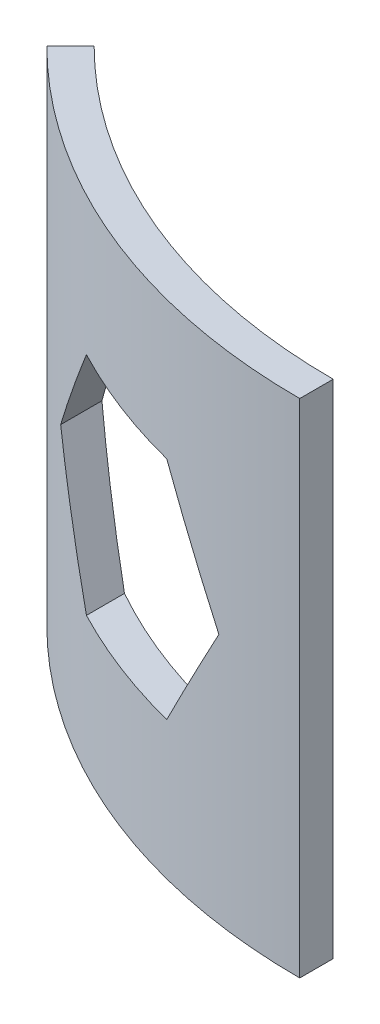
from build123d import *

# Parameters (mm, degrees)
BOSS_EXTRUDE1_DEPTH = 3000
CUT_EXTRUDE2_START  = -897.092345
CUT_EXTRUDE2_DEPTH  = 859.77825


with BuildPart() as part:
    # Sketch1 → Boss-Extrude1 (new body)
    with BuildSketch(Plane(origin=(0, 0, 0), x_dir=(1, 0, 0), z_dir=(0, 1, 0))):
        with BuildLine():
            Line((0, -3650), (0, -3450))
            ThreePointArc((0, -3450), (-1320.25784166, -3187.384387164), (-2439.518395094, -2439.518395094))
            Line((-2439.518395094, -2439.518395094), (-2580.939751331, -2580.939751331))
            ThreePointArc((-2580.939751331, -2580.939751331), (-1396.794528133, -3372.160293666), (0, -3650))
        make_face()
    extrude(amount=BOSS_EXTRUDE1_DEPTH)

    # Sketch4 → Cut-Extrude2 (cut)
    with BuildSketch(Plane.XY.offset(3650).offset(CUT_EXTRUDE2_START)):
        Polygon((-2079.422863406, 1500), (-1689.711431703, 825), (-910.288568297, 825), (-520.577136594, 1500), (-910.288568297, 2175), (-1689.711431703, 2175), align=None)
    extrude(amount=CUT_EXTRUDE2_DEPTH, mode=Mode.SUBTRACT)


solid = part.part
